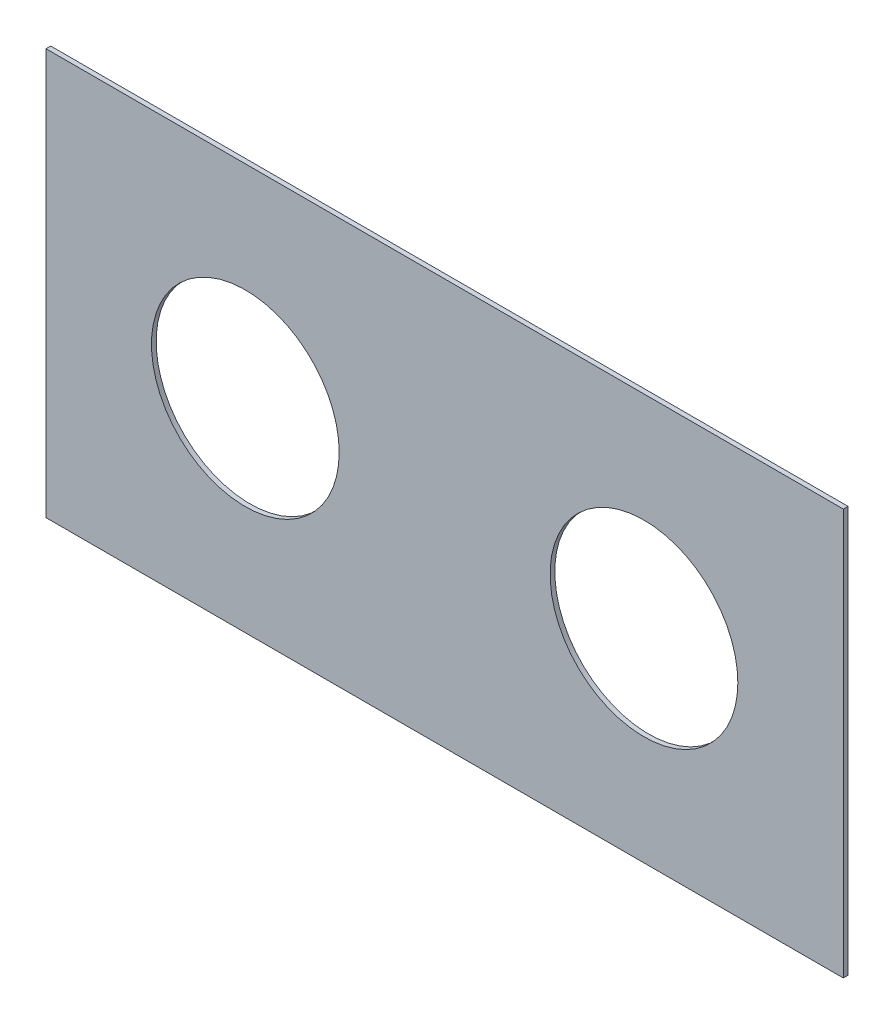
ISO-10303-21;
HEADER;
FILE_DESCRIPTION(('STEP AP214'),'2;1');
FILE_NAME('part.step','',(''),(''),'','','');
FILE_SCHEMA(('AUTOMOTIVE_DESIGN { 1 0 10303 214 1 1 1 1 }'));
ENDSEC;
DATA;
#1=APPLICATION_CONTEXT('core data for automotive mechanical design processes');
#2=APPLICATION_PROTOCOL_DEFINITION('international standard','automotive_design',2000,#1);
#3=PRODUCT_CONTEXT('',#1,'mechanical');
#4=PRODUCT('Part','Part','',(#3));
#5=PRODUCT_RELATED_PRODUCT_CATEGORY('part','',(#4));
#6=PRODUCT_DEFINITION_FORMATION('','',#4);
#7=PRODUCT_DEFINITION_CONTEXT('part definition',#1,'design');
#8=PRODUCT_DEFINITION('design','',#6,#7);
#9=PRODUCT_DEFINITION_SHAPE('','',#8);
#10=(LENGTH_UNIT() NAMED_UNIT(*) SI_UNIT(.MILLI.,.METRE.));
#11=(NAMED_UNIT(*) PLANE_ANGLE_UNIT() SI_UNIT($,.RADIAN.));
#12=(NAMED_UNIT(*) SI_UNIT($,.STERADIAN.) SOLID_ANGLE_UNIT());
#13=UNCERTAINTY_MEASURE_WITH_UNIT(LENGTH_MEASURE(1.E-05),#10,'distance_accuracy_value','');
#14=(GEOMETRIC_REPRESENTATION_CONTEXT(3) GLOBAL_UNCERTAINTY_ASSIGNED_CONTEXT((#13)) GLOBAL_UNIT_ASSIGNED_CONTEXT((#10,
#11,#12)) REPRESENTATION_CONTEXT('',''));
#15=CARTESIAN_POINT('',(0.,0.,0.));
#16=DIRECTION('',(0.,0.,1.));
#17=DIRECTION('',(1.,0.,0.));
#18=AXIS2_PLACEMENT_3D('',#15,#16,#17);
#19=CARTESIAN_POINT('',(0.,0.,3.));
#20=DIRECTION('',(0.,0.,-1.));
#21=DIRECTION('',(-1.,0.,0.));
#22=AXIS2_PLACEMENT_3D('',#19,#20,#21);
#23=PLANE('',#22);
#24=DIRECTION('',(0.,1.,0.));
#25=VECTOR('',#24,1.);
#26=CARTESIAN_POINT('',(254.8,-129.8,3.));
#27=LINE('',#26,#25);
#28=CARTESIAN_POINT('',(254.8,-129.8,3.));
#29=VERTEX_POINT('',#28);
#30=CARTESIAN_POINT('',(254.8,129.8,3.));
#31=VERTEX_POINT('',#30);
#32=EDGE_CURVE('E84',#29,#31,#27,.T.);
#33=ORIENTED_EDGE('',*,*,#32,.T.);
#34=DIRECTION('',(-1.,0.,0.));
#35=VECTOR('',#34,1.);
#36=CARTESIAN_POINT('',(-254.8,129.8,3.));
#37=LINE('',#36,#35);
#38=CARTESIAN_POINT('',(-254.8,129.8,3.));
#39=VERTEX_POINT('',#38);
#40=EDGE_CURVE('E79',#31,#39,#37,.T.);
#41=ORIENTED_EDGE('',*,*,#40,.T.);
#42=DIRECTION('',(0.,-1.,0.));
#43=VECTOR('',#42,1.);
#44=CARTESIAN_POINT('',(-254.8,-129.8,3.));
#45=LINE('',#44,#43);
#46=CARTESIAN_POINT('',(-254.8,-129.8,3.));
#47=VERTEX_POINT('',#46);
#48=EDGE_CURVE('E82',#39,#47,#45,.T.);
#49=ORIENTED_EDGE('',*,*,#48,.T.);
#50=DIRECTION('',(1.,0.,0.));
#51=VECTOR('',#50,1.);
#52=CARTESIAN_POINT('',(-254.8,-129.8,3.));
#53=LINE('',#52,#51);
#54=EDGE_CURVE('E49',#47,#29,#53,.T.);
#55=ORIENTED_EDGE('',*,*,#54,.T.);
#56=EDGE_LOOP('',(#33,#41,#49,#55));
#57=FACE_BOUND('',#56,.T.);
#58=CARTESIAN_POINT('',(-127.4,0.,3.));
#59=DIRECTION('',(0.,0.,1.));
#60=DIRECTION('',(1.,0.,0.));
#61=AXIS2_PLACEMENT_3D('',#58,#59,#60);
#62=CIRCLE('',#61,60.);
#63=CARTESIAN_POINT('',(-67.4,0.,3.));
#64=VERTEX_POINT('',#63);
#65=EDGE_CURVE('E99',#64,#64,#62,.T.);
#66=ORIENTED_EDGE('',*,*,#65,.F.);
#67=EDGE_LOOP('',(#66));
#68=FACE_BOUND('',#67,.T.);
#69=CARTESIAN_POINT('',(127.4,0.,3.));
#70=DIRECTION('',(0.,0.,1.));
#71=DIRECTION('',(1.,0.,0.));
#72=AXIS2_PLACEMENT_3D('',#69,#70,#71);
#73=CIRCLE('',#72,60.);
#74=CARTESIAN_POINT('',(187.4,0.,3.));
#75=VERTEX_POINT('',#74);
#76=EDGE_CURVE('E114',#75,#75,#73,.T.);
#77=ORIENTED_EDGE('',*,*,#76,.F.);
#78=EDGE_LOOP('',(#77));
#79=FACE_BOUND('',#78,.T.);
#80=ADVANCED_FACE('F32',(#57,#68,#79),#23,.F.);
#81=CARTESIAN_POINT('',(0.,0.,0.));
#82=DIRECTION('',(0.,0.,-1.));
#83=DIRECTION('',(-1.,0.,0.));
#84=AXIS2_PLACEMENT_3D('',#81,#82,#83);
#85=PLANE('',#84);
#86=CARTESIAN_POINT('',(-127.4,0.,0.));
#87=DIRECTION('',(0.,0.,1.));
#88=DIRECTION('',(1.,0.,0.));
#89=AXIS2_PLACEMENT_3D('',#86,#87,#88);
#90=CIRCLE('',#89,60.);
#91=CARTESIAN_POINT('',(-67.4,0.,0.));
#92=VERTEX_POINT('',#91);
#93=EDGE_CURVE('E111',#92,#92,#90,.T.);
#94=ORIENTED_EDGE('',*,*,#93,.T.);
#95=EDGE_LOOP('',(#94));
#96=FACE_BOUND('',#95,.T.);
#97=DIRECTION('',(0.,1.,0.));
#98=VECTOR('',#97,1.);
#99=CARTESIAN_POINT('',(254.8,-129.8,0.));
#100=LINE('',#99,#98);
#101=CARTESIAN_POINT('',(254.8,-129.8,0.));
#102=VERTEX_POINT('',#101);
#103=CARTESIAN_POINT('',(254.8,129.8,0.));
#104=VERTEX_POINT('',#103);
#105=EDGE_CURVE('E96',#102,#104,#100,.T.);
#106=ORIENTED_EDGE('',*,*,#105,.F.);
#107=DIRECTION('',(1.,0.,0.));
#108=VECTOR('',#107,1.);
#109=CARTESIAN_POINT('',(-254.8,-129.8,0.));
#110=LINE('',#109,#108);
#111=CARTESIAN_POINT('',(-254.8,-129.8,0.));
#112=VERTEX_POINT('',#111);
#113=EDGE_CURVE('E72',#112,#102,#110,.T.);
#114=ORIENTED_EDGE('',*,*,#113,.F.);
#115=DIRECTION('',(0.,-1.,0.));
#116=VECTOR('',#115,1.);
#117=CARTESIAN_POINT('',(-254.8,-129.8,0.));
#118=LINE('',#117,#116);
#119=CARTESIAN_POINT('',(-254.8,129.8,0.));
#120=VERTEX_POINT('',#119);
#121=EDGE_CURVE('E66',#120,#112,#118,.T.);
#122=ORIENTED_EDGE('',*,*,#121,.F.);
#123=DIRECTION('',(-1.,0.,0.));
#124=VECTOR('',#123,1.);
#125=CARTESIAN_POINT('',(-254.8,129.8,0.));
#126=LINE('',#125,#124);
#127=EDGE_CURVE('E88',#104,#120,#126,.T.);
#128=ORIENTED_EDGE('',*,*,#127,.F.);
#129=EDGE_LOOP('',(#106,#114,#122,#128));
#130=FACE_BOUND('',#129,.T.);
#131=CARTESIAN_POINT('',(127.4,0.,0.));
#132=DIRECTION('',(0.,0.,1.));
#133=DIRECTION('',(1.,0.,0.));
#134=AXIS2_PLACEMENT_3D('',#131,#132,#133);
#135=CIRCLE('',#134,60.);
#136=CARTESIAN_POINT('',(187.4,0.,0.));
#137=VERTEX_POINT('',#136);
#138=EDGE_CURVE('E117',#137,#137,#135,.T.);
#139=ORIENTED_EDGE('',*,*,#138,.T.);
#140=EDGE_LOOP('',(#139));
#141=FACE_BOUND('',#140,.T.);
#142=ADVANCED_FACE('F107',(#96,#130,#141),#85,.T.);
#143=CARTESIAN_POINT('',(254.8,-129.8,3.));
#144=DIRECTION('',(-1.,0.,0.));
#145=DIRECTION('',(0.,0.,1.));
#146=AXIS2_PLACEMENT_3D('',#143,#144,#145);
#147=PLANE('',#146);
#148=ORIENTED_EDGE('',*,*,#105,.T.);
#149=DIRECTION('',(0.,0.,-1.));
#150=VECTOR('',#149,1.);
#151=CARTESIAN_POINT('',(254.8,129.8,3.));
#152=LINE('',#151,#150);
#153=EDGE_CURVE('E11',#31,#104,#152,.T.);
#154=ORIENTED_EDGE('',*,*,#153,.F.);
#155=ORIENTED_EDGE('',*,*,#32,.F.);
#156=DIRECTION('',(0.,0.,-1.));
#157=VECTOR('',#156,1.);
#158=CARTESIAN_POINT('',(254.8,-129.8,3.));
#159=LINE('',#158,#157);
#160=EDGE_CURVE('E92',#29,#102,#159,.T.);
#161=ORIENTED_EDGE('',*,*,#160,.T.);
#162=EDGE_LOOP('',(#148,#154,#155,#161));
#163=FACE_BOUND('',#162,.T.);
#164=ADVANCED_FACE('F34',(#163),#147,.F.);
#165=CARTESIAN_POINT('',(-254.8,129.8,3.));
#166=DIRECTION('',(0.,-1.,0.));
#167=DIRECTION('',(1.,0.,0.));
#168=AXIS2_PLACEMENT_3D('',#165,#166,#167);
#169=PLANE('',#168);
#170=ORIENTED_EDGE('',*,*,#127,.T.);
#171=DIRECTION('',(0.,0.,-1.));
#172=VECTOR('',#171,1.);
#173=CARTESIAN_POINT('',(-254.8,129.8,3.));
#174=LINE('',#173,#172);
#175=EDGE_CURVE('E41',#39,#120,#174,.T.);
#176=ORIENTED_EDGE('',*,*,#175,.F.);
#177=ORIENTED_EDGE('',*,*,#40,.F.);
#178=ORIENTED_EDGE('',*,*,#153,.T.);
#179=EDGE_LOOP('',(#170,#176,#177,#178));
#180=FACE_BOUND('',#179,.T.);
#181=ADVANCED_FACE('F87',(#180),#169,.F.);
#182=CARTESIAN_POINT('',(-254.8,-129.8,3.));
#183=DIRECTION('',(1.,0.,0.));
#184=DIRECTION('',(0.,1.,0.));
#185=AXIS2_PLACEMENT_3D('',#182,#183,#184);
#186=PLANE('',#185);
#187=ORIENTED_EDGE('',*,*,#121,.T.);
#188=DIRECTION('',(0.,0.,-1.));
#189=VECTOR('',#188,1.);
#190=CARTESIAN_POINT('',(-254.8,-129.8,3.));
#191=LINE('',#190,#189);
#192=EDGE_CURVE('E89',#47,#112,#191,.T.);
#193=ORIENTED_EDGE('',*,*,#192,.F.);
#194=ORIENTED_EDGE('',*,*,#48,.F.);
#195=ORIENTED_EDGE('',*,*,#175,.T.);
#196=EDGE_LOOP('',(#187,#193,#194,#195));
#197=FACE_BOUND('',#196,.T.);
#198=ADVANCED_FACE('F90',(#197),#186,.F.);
#199=CARTESIAN_POINT('',(-254.8,-129.8,3.));
#200=DIRECTION('',(0.,1.,0.));
#201=DIRECTION('',(0.,0.,1.));
#202=AXIS2_PLACEMENT_3D('',#199,#200,#201);
#203=PLANE('',#202);
#204=ORIENTED_EDGE('',*,*,#113,.T.);
#205=ORIENTED_EDGE('',*,*,#160,.F.);
#206=ORIENTED_EDGE('',*,*,#54,.F.);
#207=ORIENTED_EDGE('',*,*,#192,.T.);
#208=EDGE_LOOP('',(#204,#205,#206,#207));
#209=FACE_BOUND('',#208,.T.);
#210=ADVANCED_FACE('F104',(#209),#203,.F.);
#211=CARTESIAN_POINT('',(-127.4,0.,3.));
#212=DIRECTION('',(0.,0.,-1.));
#213=DIRECTION('',(-1.,0.,0.));
#214=AXIS2_PLACEMENT_3D('',#211,#212,#213);
#215=CYLINDRICAL_SURFACE('',#214,60.);
#216=ORIENTED_EDGE('',*,*,#65,.T.);
#217=EDGE_LOOP('',(#216));
#218=FACE_BOUND('',#217,.T.);
#219=ORIENTED_EDGE('',*,*,#93,.F.);
#220=EDGE_LOOP('',(#219));
#221=FACE_BOUND('',#220,.T.);
#222=ADVANCED_FACE('F134',(#218,#221),#215,.F.);
#223=CARTESIAN_POINT('',(127.4,0.,3.));
#224=DIRECTION('',(0.,0.,-1.));
#225=DIRECTION('',(-1.,0.,0.));
#226=AXIS2_PLACEMENT_3D('',#223,#224,#225);
#227=CYLINDRICAL_SURFACE('',#226,60.);
#228=ORIENTED_EDGE('',*,*,#76,.T.);
#229=EDGE_LOOP('',(#228));
#230=FACE_BOUND('',#229,.T.);
#231=ORIENTED_EDGE('',*,*,#138,.F.);
#232=EDGE_LOOP('',(#231));
#233=FACE_BOUND('',#232,.T.);
#234=ADVANCED_FACE('F123',(#230,#233),#227,.F.);
#235=CLOSED_SHELL('',(#80,#142,#164,#181,#198,#210,#222,#234));
#236=MANIFOLD_SOLID_BREP('B2',#235);
#237=ADVANCED_BREP_SHAPE_REPRESENTATION('',(#18,#236),#14);
#238=SHAPE_DEFINITION_REPRESENTATION(#9,#237);
ENDSEC;
END-ISO-10303-21;
